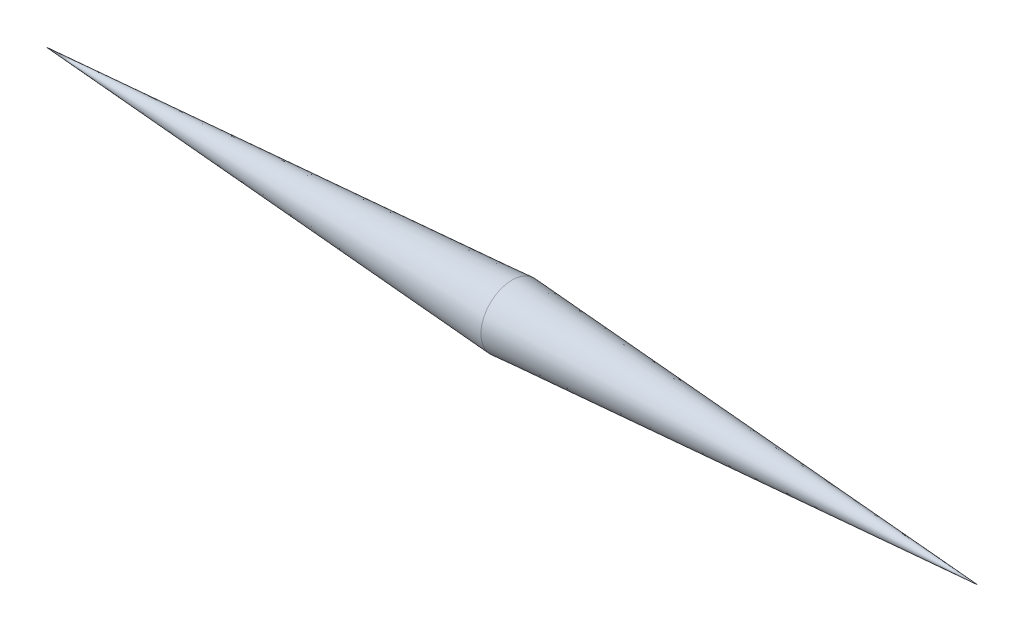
from build123d import *


with BuildPart() as part:
    # Croquis1 → Revoluci_n1 (revolve)
    with BuildSketch(Plane.XY, mode=Mode.PRIVATE) as revoluci_n1_sk:
        Polygon((0, 0), (150, 0), (75, 5), align=None)
    revolve(revoluci_n1_sk.sketch.rotate(Axis((0, 0, 0), (1, 0, 0)), 270), axis=Axis((0, 0, 0), (1, 0, 0)))


solid = part.part
